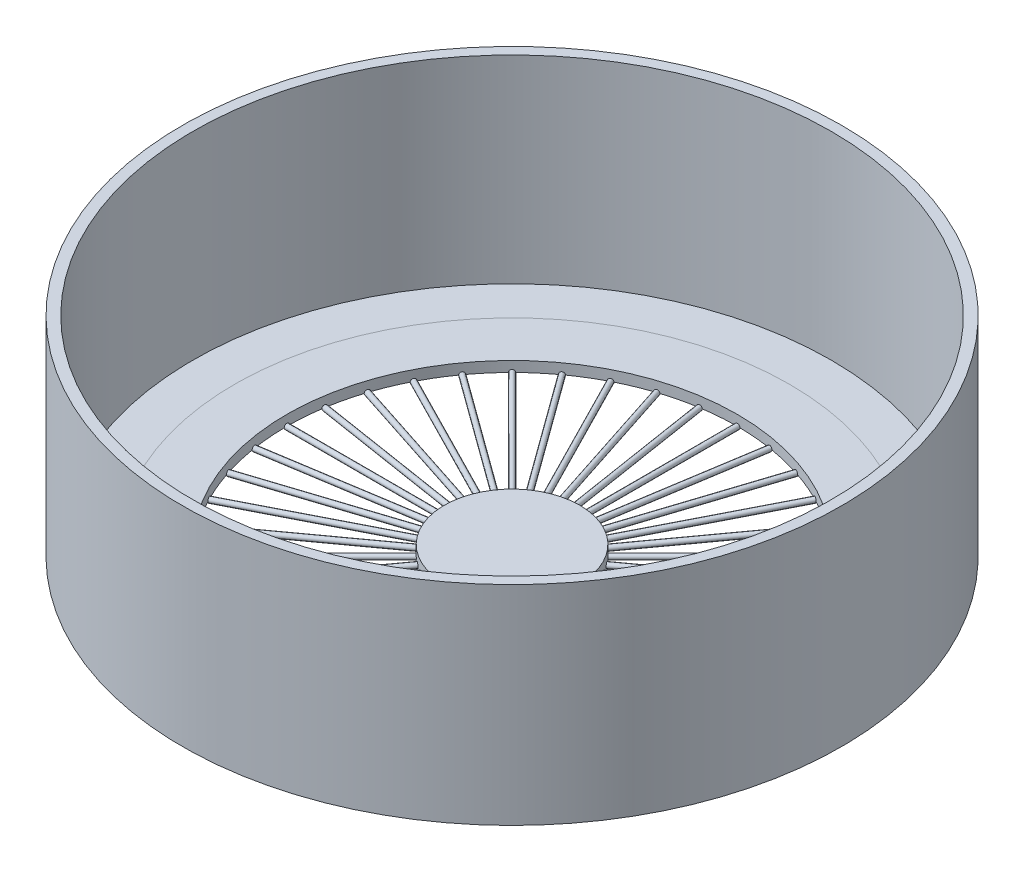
from build123d import *

# Parameters (mm, degrees)
SWEEP1_PROFILE_R    = 2.5
CIRPATTERN1_COUNT   = 40
SKETCH46_R          = 65
BOSS_EXTRUDE1_DEPTH = 10
BOSS_EXTRUDE2_START = 10
SKETCH47_R          = 65
BOSS_EXTRUDE2_DEPTH = 10


with BuildPart() as part:
    # Sketch1 → Revolve1 (revolve)
    with BuildSketch(Plane.XY, mode=Mode.PRIVATE) as revolve1_sk:
        Polygon((266.000015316, 0), (316, 0.039136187), (316, 200.039136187), (306, 200.039136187), (306, 10.031312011), (265.996101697, 10), (216.000015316, 10), (216.000015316, 0), align=None)
    revolve(revolve1_sk.sketch.rotate(Axis((0, 0, 0), (0, 1, 0)), 90), axis=Axis((0, 0, 0), (0, 1, 0)))

    # Sweep1: sweep along a path in Sketch2
    with BuildLine(Plane(origin=(0, 0, 0), x_dir=(-1, 0, 0), z_dir=(0, -1, 0))) as sweep1_path:
        Line((0, -216.000015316), (0, 216.000015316))
    # Sweep1 profile (on start of the path) → Sweep1 (sweep)
    with BuildSketch(Plane(origin=(0, 0, 216.000015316), x_dir=(-1, 0, 0), z_dir=(0, 0, -1))):
        Circle(SWEEP1_PROFILE_R)
    sweep1 = sweep(path=sweep1_path.line)

    # CirPattern1: Sweep1 ×40 about axis
    cirpattern1_axis = Axis((0, 0, 0), (0, 1, 0))
    for i in range(1, CIRPATTERN1_COUNT):
        add(sweep1.rotate(cirpattern1_axis, i * 360 / CIRPATTERN1_COUNT))

    # Sketch46 → Boss-Extrude1 (add)
    with BuildSketch(Plane.XZ):
        with Locations(Location((0, 0, 0), (0, 0, 270))):
            Circle(SKETCH46_R)
    extrude(amount=-BOSS_EXTRUDE1_DEPTH)

    # Sketch47 → Boss-Extrude2 (add)
    with BuildSketch(Plane.XZ.offset(BOSS_EXTRUDE2_START)):
        with Locations(Location((0, 0, 0), (0, 0, 270))):
            Circle(SKETCH47_R)
    extrude(amount=-BOSS_EXTRUDE2_DEPTH)


solid = part.part
